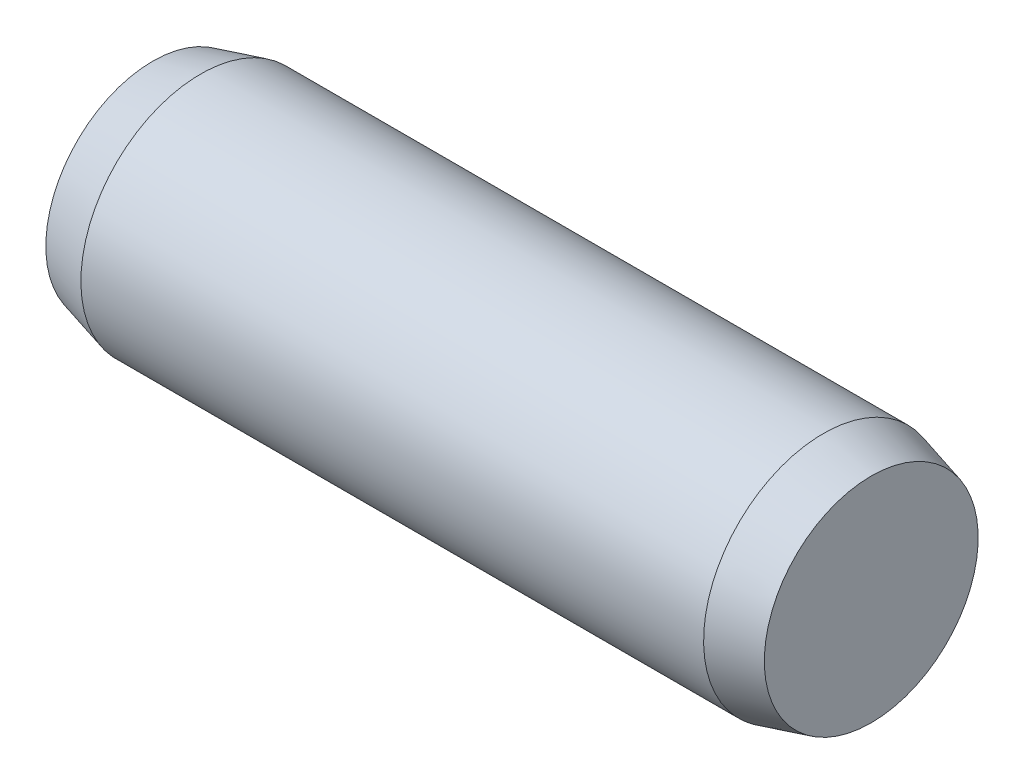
from build123d import *


with BuildPart() as part:
    # BodySke → Body (revolve)
    with BuildSketch(Plane.XY, mode=Mode.PRIVATE) as body_sk:
        Polygon((28, 5), (30, 4.464101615), (30, 0), (0, 0), (0, 4.464101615), (2, 5), align=None)
    revolve(body_sk.sketch.rotate(Axis((0, 0, 0), (1, 0, 0)), 180), axis=Axis((0, 0, 0), (1, 0, 0)))


solid = part.part
